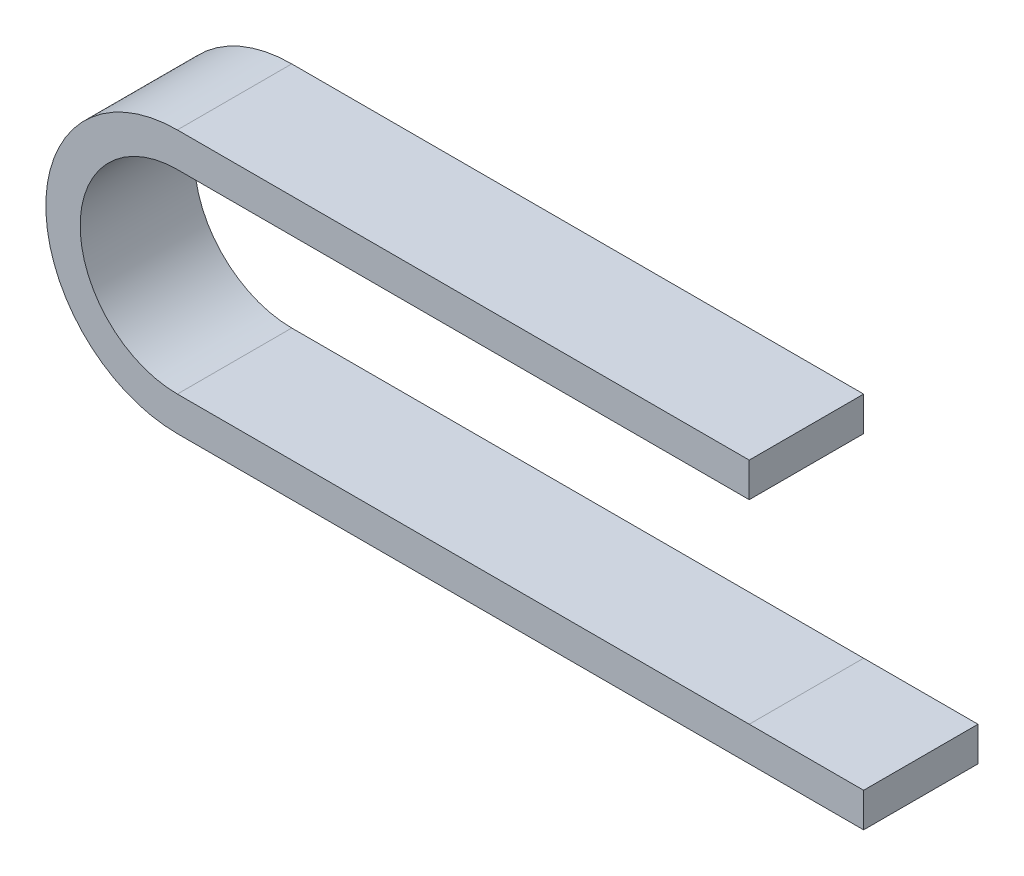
ISO-10303-21;
HEADER;
FILE_DESCRIPTION(('STEP AP214'),'2;1');
FILE_NAME('part.step','',(''),(''),'','','');
FILE_SCHEMA(('AUTOMOTIVE_DESIGN { 1 0 10303 214 1 1 1 1 }'));
ENDSEC;
DATA;
#1=APPLICATION_CONTEXT('core data for automotive mechanical design processes');
#2=APPLICATION_PROTOCOL_DEFINITION('international standard','automotive_design',2000,#1);
#3=PRODUCT_CONTEXT('',#1,'mechanical');
#4=PRODUCT('Part','Part','',(#3));
#5=PRODUCT_RELATED_PRODUCT_CATEGORY('part','',(#4));
#6=PRODUCT_DEFINITION_FORMATION('','',#4);
#7=PRODUCT_DEFINITION_CONTEXT('part definition',#1,'design');
#8=PRODUCT_DEFINITION('design','',#6,#7);
#9=PRODUCT_DEFINITION_SHAPE('','',#8);
#10=(LENGTH_UNIT() NAMED_UNIT(*) SI_UNIT(.MILLI.,.METRE.));
#11=(NAMED_UNIT(*) PLANE_ANGLE_UNIT() SI_UNIT($,.RADIAN.));
#12=(NAMED_UNIT(*) SI_UNIT($,.STERADIAN.) SOLID_ANGLE_UNIT());
#13=UNCERTAINTY_MEASURE_WITH_UNIT(LENGTH_MEASURE(1.E-05),#10,'distance_accuracy_value','');
#14=(GEOMETRIC_REPRESENTATION_CONTEXT(3) GLOBAL_UNCERTAINTY_ASSIGNED_CONTEXT((#13)) GLOBAL_UNIT_ASSIGNED_CONTEXT((#10,
#11,#12)) REPRESENTATION_CONTEXT('',''));
#15=CARTESIAN_POINT('',(0.,0.,0.));
#16=DIRECTION('',(0.,0.,1.));
#17=DIRECTION('',(1.,0.,0.));
#18=AXIS2_PLACEMENT_3D('',#15,#16,#17);
#19=CARTESIAN_POINT('',(0.,0.75,2.5));
#20=DIRECTION('',(0.,1.,0.));
#21=DIRECTION('',(0.,0.,1.));
#22=AXIS2_PLACEMENT_3D('',#19,#20,#21);
#23=PLANE('',#22);
#24=DIRECTION('',(1.,0.,0.));
#25=VECTOR('',#24,1.);
#26=CARTESIAN_POINT('',(0.,0.75,2.5));
#27=LINE('',#26,#25);
#28=CARTESIAN_POINT('',(0.,0.75,2.5));
#29=VERTEX_POINT('',#28);
#30=CARTESIAN_POINT('',(25.,0.75,2.5));
#31=VERTEX_POINT('',#30);
#32=EDGE_CURVE('E143',#29,#31,#27,.T.);
#33=ORIENTED_EDGE('',*,*,#32,.T.);
#34=DIRECTION('',(0.,0.,-1.));
#35=VECTOR('',#34,1.);
#36=CARTESIAN_POINT('',(25.,0.75,2.5));
#37=LINE('',#36,#35);
#38=CARTESIAN_POINT('',(25.,0.75,-2.5));
#39=VERTEX_POINT('',#38);
#40=EDGE_CURVE('E11',#31,#39,#37,.T.);
#41=ORIENTED_EDGE('',*,*,#40,.T.);
#42=DIRECTION('',(1.,0.,0.));
#43=VECTOR('',#42,1.);
#44=CARTESIAN_POINT('',(0.,0.75,-2.5));
#45=LINE('',#44,#43);
#46=CARTESIAN_POINT('',(0.,0.75,-2.5));
#47=VERTEX_POINT('',#46);
#48=EDGE_CURVE('E189',#47,#39,#45,.T.);
#49=ORIENTED_EDGE('',*,*,#48,.F.);
#50=DIRECTION('',(0.,0.,1.));
#51=VECTOR('',#50,1.);
#52=CARTESIAN_POINT('',(0.,0.75,2.5));
#53=LINE('',#52,#51);
#54=EDGE_CURVE('E129',#47,#29,#53,.T.);
#55=ORIENTED_EDGE('',*,*,#54,.T.);
#56=EDGE_LOOP('',(#33,#41,#49,#55));
#57=FACE_BOUND('',#56,.T.);
#58=ADVANCED_FACE('F33',(#57),#23,.T.);
#59=CARTESIAN_POINT('',(0.,-0.750000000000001,2.5));
#60=DIRECTION('',(0.,-1.,0.));
#61=DIRECTION('',(0.,0.,-1.));
#62=AXIS2_PLACEMENT_3D('',#59,#60,#61);
#63=PLANE('',#62);
#64=DIRECTION('',(1.,0.,0.));
#65=VECTOR('',#64,1.);
#66=CARTESIAN_POINT('',(0.,-0.750000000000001,-2.5));
#67=LINE('',#66,#65);
#68=CARTESIAN_POINT('',(0.,-0.750000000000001,-2.5));
#69=VERTEX_POINT('',#68);
#70=CARTESIAN_POINT('',(25.,-0.750000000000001,-2.5));
#71=VERTEX_POINT('',#70);
#72=EDGE_CURVE('E137',#69,#71,#67,.T.);
#73=ORIENTED_EDGE('',*,*,#72,.T.);
#74=DIRECTION('',(0.,0.,1.));
#75=VECTOR('',#74,1.);
#76=CARTESIAN_POINT('',(25.,-0.750000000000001,2.5));
#77=LINE('',#76,#75);
#78=CARTESIAN_POINT('',(25.,-0.750000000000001,2.5));
#79=VERTEX_POINT('',#78);
#80=EDGE_CURVE('E37',#71,#79,#77,.T.);
#81=ORIENTED_EDGE('',*,*,#80,.T.);
#82=DIRECTION('',(1.,0.,0.));
#83=VECTOR('',#82,1.);
#84=CARTESIAN_POINT('',(0.,-0.750000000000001,2.5));
#85=LINE('',#84,#83);
#86=CARTESIAN_POINT('',(0.,-0.750000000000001,2.5));
#87=VERTEX_POINT('',#86);
#88=EDGE_CURVE('E113',#87,#79,#85,.T.);
#89=ORIENTED_EDGE('',*,*,#88,.F.);
#90=DIRECTION('',(0.,0.,-1.));
#91=VECTOR('',#90,1.);
#92=CARTESIAN_POINT('',(0.,-0.750000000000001,2.5));
#93=LINE('',#92,#91);
#94=EDGE_CURVE('E123',#87,#69,#93,.T.);
#95=ORIENTED_EDGE('',*,*,#94,.T.);
#96=EDGE_LOOP('',(#73,#81,#89,#95));
#97=FACE_BOUND('',#96,.T.);
#98=ADVANCED_FACE('F132',(#97),#63,.T.);
#99=CARTESIAN_POINT('',(0.,9.25,2.5));
#100=DIRECTION('',(0.,1.,0.));
#101=DIRECTION('',(-1.,0.,0.));
#102=AXIS2_PLACEMENT_3D('',#99,#100,#101);
#103=PLANE('',#102);
#104=DIRECTION('',(0.,0.,1.));
#105=VECTOR('',#104,1.);
#106=CARTESIAN_POINT('',(0.,9.25,2.5));
#107=LINE('',#106,#105);
#108=CARTESIAN_POINT('',(0.,9.25,-2.5));
#109=VERTEX_POINT('',#108);
#110=CARTESIAN_POINT('',(0.,9.25,2.5));
#111=VERTEX_POINT('',#110);
#112=EDGE_CURVE('E120',#109,#111,#107,.T.);
#113=ORIENTED_EDGE('',*,*,#112,.F.);
#114=DIRECTION('',(1.,0.,0.));
#115=VECTOR('',#114,1.);
#116=CARTESIAN_POINT('',(0.,9.25,-2.5));
#117=LINE('',#116,#115);
#118=CARTESIAN_POINT('',(25.0000000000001,9.25,-2.5));
#119=VERTEX_POINT('',#118);
#120=EDGE_CURVE('E165',#109,#119,#117,.T.);
#121=ORIENTED_EDGE('',*,*,#120,.T.);
#122=DIRECTION('',(0.,0.,1.));
#123=VECTOR('',#122,1.);
#124=CARTESIAN_POINT('',(25.0000000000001,9.25,2.5));
#125=LINE('',#124,#123);
#126=CARTESIAN_POINT('',(25.0000000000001,9.25,2.5));
#127=VERTEX_POINT('',#126);
#128=EDGE_CURVE('E159',#119,#127,#125,.T.);
#129=ORIENTED_EDGE('',*,*,#128,.T.);
#130=DIRECTION('',(1.,0.,0.));
#131=VECTOR('',#130,1.);
#132=CARTESIAN_POINT('',(0.,9.25,2.5));
#133=LINE('',#132,#131);
#134=EDGE_CURVE('E168',#111,#127,#133,.T.);
#135=ORIENTED_EDGE('',*,*,#134,.F.);
#136=EDGE_LOOP('',(#113,#121,#129,#135));
#137=FACE_BOUND('',#136,.T.);
#138=ADVANCED_FACE('F35',(#137),#103,.F.);
#139=CARTESIAN_POINT('',(0.,10.75,2.5));
#140=DIRECTION('',(0.,-1.,0.));
#141=DIRECTION('',(1.,0.,0.));
#142=AXIS2_PLACEMENT_3D('',#139,#140,#141);
#143=PLANE('',#142);
#144=DIRECTION('',(0.,0.,-1.));
#145=VECTOR('',#144,1.);
#146=CARTESIAN_POINT('',(0.,10.75,2.5));
#147=LINE('',#146,#145);
#148=CARTESIAN_POINT('',(0.,10.75,2.5));
#149=VERTEX_POINT('',#148);
#150=CARTESIAN_POINT('',(0.,10.75,-2.5));
#151=VERTEX_POINT('',#150);
#152=EDGE_CURVE('E141',#149,#151,#147,.T.);
#153=ORIENTED_EDGE('',*,*,#152,.F.);
#154=DIRECTION('',(1.,0.,0.));
#155=VECTOR('',#154,1.);
#156=CARTESIAN_POINT('',(0.,10.75,2.5));
#157=LINE('',#156,#155);
#158=CARTESIAN_POINT('',(25.0000000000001,10.75,2.5));
#159=VERTEX_POINT('',#158);
#160=EDGE_CURVE('E115',#149,#159,#157,.T.);
#161=ORIENTED_EDGE('',*,*,#160,.T.);
#162=DIRECTION('',(0.,0.,-1.));
#163=VECTOR('',#162,1.);
#164=CARTESIAN_POINT('',(25.0000000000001,10.75,2.5));
#165=LINE('',#164,#163);
#166=CARTESIAN_POINT('',(25.0000000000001,10.75,-2.5));
#167=VERTEX_POINT('',#166);
#168=EDGE_CURVE('E155',#159,#167,#165,.T.);
#169=ORIENTED_EDGE('',*,*,#168,.T.);
#170=DIRECTION('',(1.,0.,0.));
#171=VECTOR('',#170,1.);
#172=CARTESIAN_POINT('',(0.,10.75,-2.5));
#173=LINE('',#172,#171);
#174=EDGE_CURVE('E162',#151,#167,#173,.T.);
#175=ORIENTED_EDGE('',*,*,#174,.F.);
#176=EDGE_LOOP('',(#153,#161,#169,#175));
#177=FACE_BOUND('',#176,.T.);
#178=ADVANCED_FACE('F194',(#177),#143,.F.);
#179=CARTESIAN_POINT('',(0.,5.,0.));
#180=DIRECTION('',(0.,0.,-1.));
#181=DIRECTION('',(-1.,0.,0.));
#182=AXIS2_PLACEMENT_3D('',#179,#180,#181);
#183=CYLINDRICAL_SURFACE('',#182,4.25);
#184=ORIENTED_EDGE('',*,*,#54,.F.);
#185=CARTESIAN_POINT('',(0.,5.,-2.5));
#186=DIRECTION('',(0.,0.,-1.));
#187=DIRECTION('',(-1.,0.,0.));
#188=AXIS2_PLACEMENT_3D('',#185,#186,#187);
#189=CIRCLE('',#188,4.25);
#190=EDGE_CURVE('E147',#47,#109,#189,.T.);
#191=ORIENTED_EDGE('',*,*,#190,.T.);
#192=ORIENTED_EDGE('',*,*,#112,.T.);
#193=CARTESIAN_POINT('',(0.,5.,2.5));
#194=DIRECTION('',(0.,0.,-1.));
#195=DIRECTION('',(-1.,0.,0.));
#196=AXIS2_PLACEMENT_3D('',#193,#194,#195);
#197=CIRCLE('',#196,4.25);
#198=EDGE_CURVE('E150',#29,#111,#197,.T.);
#199=ORIENTED_EDGE('',*,*,#198,.F.);
#200=EDGE_LOOP('',(#184,#191,#192,#199));
#201=FACE_BOUND('',#200,.T.);
#202=ADVANCED_FACE('F183',(#201),#183,.F.);
#203=CARTESIAN_POINT('',(0.,5.,0.));
#204=DIRECTION('',(0.,0.,-1.));
#205=DIRECTION('',(-1.,0.,0.));
#206=AXIS2_PLACEMENT_3D('',#203,#204,#205);
#207=CYLINDRICAL_SURFACE('',#206,5.75);
#208=ORIENTED_EDGE('',*,*,#94,.F.);
#209=CARTESIAN_POINT('',(0.,5.,2.5));
#210=DIRECTION('',(0.,0.,-1.));
#211=DIRECTION('',(-1.,0.,0.));
#212=AXIS2_PLACEMENT_3D('',#209,#210,#211);
#213=CIRCLE('',#212,5.75);
#214=EDGE_CURVE('E108',#87,#149,#213,.T.);
#215=ORIENTED_EDGE('',*,*,#214,.T.);
#216=ORIENTED_EDGE('',*,*,#152,.T.);
#217=CARTESIAN_POINT('',(0.,5.,-2.5));
#218=DIRECTION('',(0.,0.,-1.));
#219=DIRECTION('',(-1.,0.,0.));
#220=AXIS2_PLACEMENT_3D('',#217,#218,#219);
#221=CIRCLE('',#220,5.75);
#222=EDGE_CURVE('E119',#69,#151,#221,.T.);
#223=ORIENTED_EDGE('',*,*,#222,.F.);
#224=EDGE_LOOP('',(#208,#215,#216,#223));
#225=FACE_BOUND('',#224,.T.);
#226=ADVANCED_FACE('F124',(#225),#207,.T.);
#227=CARTESIAN_POINT('',(0.,0.75,2.5));
#228=DIRECTION('',(0.,0.,1.));
#229=DIRECTION('',(0.,-1.,0.));
#230=AXIS2_PLACEMENT_3D('',#227,#228,#229);
#231=PLANE('',#230);
#232=DIRECTION('',(0.,-1.,0.));
#233=VECTOR('',#232,1.);
#234=CARTESIAN_POINT('',(30.,0.75,2.5));
#235=LINE('',#234,#233);
#236=CARTESIAN_POINT('',(30.,0.75,2.5));
#237=VERTEX_POINT('',#236);
#238=CARTESIAN_POINT('',(30.,-0.750000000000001,2.5));
#239=VERTEX_POINT('',#238);
#240=EDGE_CURVE('E208',#237,#239,#235,.T.);
#241=ORIENTED_EDGE('',*,*,#240,.F.);
#242=EDGE_CURVE('E198',#31,#237,#27,.T.);
#243=ORIENTED_EDGE('',*,*,#242,.F.);
#244=ORIENTED_EDGE('',*,*,#32,.F.);
#245=ORIENTED_EDGE('',*,*,#198,.T.);
#246=ORIENTED_EDGE('',*,*,#134,.T.);
#247=DIRECTION('',(0.,1.,0.));
#248=VECTOR('',#247,1.);
#249=CARTESIAN_POINT('',(25.0000000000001,9.25,2.5));
#250=LINE('',#249,#248);
#251=EDGE_CURVE('E153',#127,#159,#250,.T.);
#252=ORIENTED_EDGE('',*,*,#251,.T.);
#253=ORIENTED_EDGE('',*,*,#160,.F.);
#254=ORIENTED_EDGE('',*,*,#214,.F.);
#255=ORIENTED_EDGE('',*,*,#88,.T.);
#256=EDGE_CURVE('E135',#79,#239,#85,.T.);
#257=ORIENTED_EDGE('',*,*,#256,.T.);
#258=EDGE_LOOP('',(#241,#243,#244,#245,#246,#252,#253,#254,#255,#257));
#259=FACE_BOUND('',#258,.T.);
#260=ADVANCED_FACE('F111',(#259),#231,.T.);
#261=ORIENTED_EDGE('',*,*,#40,.F.);
#262=ORIENTED_EDGE('',*,*,#242,.T.);
#263=DIRECTION('',(0.,0.,1.));
#264=VECTOR('',#263,1.);
#265=CARTESIAN_POINT('',(30.,0.75,2.5));
#266=LINE('',#265,#264);
#267=CARTESIAN_POINT('',(30.,0.75,-2.5));
#268=VERTEX_POINT('',#267);
#269=EDGE_CURVE('E130',#268,#237,#266,.T.);
#270=ORIENTED_EDGE('',*,*,#269,.F.);
#271=EDGE_CURVE('E196',#39,#268,#45,.T.);
#272=ORIENTED_EDGE('',*,*,#271,.F.);
#273=EDGE_LOOP('',(#261,#262,#270,#272));
#274=FACE_BOUND('',#273,.T.);
#275=ADVANCED_FACE('F212',(#274),#23,.T.);
#276=CARTESIAN_POINT('',(0.,0.75,-2.5));
#277=DIRECTION('',(0.,0.,-1.));
#278=DIRECTION('',(0.,1.,0.));
#279=AXIS2_PLACEMENT_3D('',#276,#277,#278);
#280=PLANE('',#279);
#281=DIRECTION('',(0.,1.,0.));
#282=VECTOR('',#281,1.);
#283=CARTESIAN_POINT('',(30.,0.75,-2.5));
#284=LINE('',#283,#282);
#285=CARTESIAN_POINT('',(30.,-0.750000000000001,-2.5));
#286=VERTEX_POINT('',#285);
#287=EDGE_CURVE('E203',#286,#268,#284,.T.);
#288=ORIENTED_EDGE('',*,*,#287,.F.);
#289=EDGE_CURVE('E134',#71,#286,#67,.T.);
#290=ORIENTED_EDGE('',*,*,#289,.F.);
#291=ORIENTED_EDGE('',*,*,#72,.F.);
#292=ORIENTED_EDGE('',*,*,#222,.T.);
#293=ORIENTED_EDGE('',*,*,#174,.T.);
#294=DIRECTION('',(0.,-1.,0.));
#295=VECTOR('',#294,1.);
#296=CARTESIAN_POINT('',(25.0000000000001,9.25,-2.5));
#297=LINE('',#296,#295);
#298=EDGE_CURVE('E157',#167,#119,#297,.T.);
#299=ORIENTED_EDGE('',*,*,#298,.T.);
#300=ORIENTED_EDGE('',*,*,#120,.F.);
#301=ORIENTED_EDGE('',*,*,#190,.F.);
#302=ORIENTED_EDGE('',*,*,#48,.T.);
#303=ORIENTED_EDGE('',*,*,#271,.T.);
#304=EDGE_LOOP('',(#288,#290,#291,#292,#293,#299,#300,#301,#302,#303));
#305=FACE_BOUND('',#304,.T.);
#306=ADVANCED_FACE('F188',(#305),#280,.T.);
#307=ORIENTED_EDGE('',*,*,#80,.F.);
#308=ORIENTED_EDGE('',*,*,#289,.T.);
#309=DIRECTION('',(0.,0.,-1.));
#310=VECTOR('',#309,1.);
#311=CARTESIAN_POINT('',(30.,-0.750000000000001,2.5));
#312=LINE('',#311,#310);
#313=EDGE_CURVE('E205',#239,#286,#312,.T.);
#314=ORIENTED_EDGE('',*,*,#313,.F.);
#315=ORIENTED_EDGE('',*,*,#256,.F.);
#316=EDGE_LOOP('',(#307,#308,#314,#315));
#317=FACE_BOUND('',#316,.T.);
#318=ADVANCED_FACE('F217',(#317),#63,.T.);
#319=CARTESIAN_POINT('',(25.0000000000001,10.75,2.5));
#320=DIRECTION('',(-1.,0.,0.));
#321=DIRECTION('',(0.,0.,-1.));
#322=AXIS2_PLACEMENT_3D('',#319,#320,#321);
#323=PLANE('',#322);
#324=ORIENTED_EDGE('',*,*,#251,.F.);
#325=ORIENTED_EDGE('',*,*,#128,.F.);
#326=ORIENTED_EDGE('',*,*,#298,.F.);
#327=ORIENTED_EDGE('',*,*,#168,.F.);
#328=EDGE_LOOP('',(#324,#325,#326,#327));
#329=FACE_BOUND('',#328,.T.);
#330=ADVANCED_FACE('F192',(#329),#323,.F.);
#331=CARTESIAN_POINT('',(30.,-0.750000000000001,2.5));
#332=DIRECTION('',(1.,0.,0.));
#333=DIRECTION('',(0.,0.,-1.));
#334=AXIS2_PLACEMENT_3D('',#331,#332,#333);
#335=PLANE('',#334);
#336=ORIENTED_EDGE('',*,*,#240,.T.);
#337=ORIENTED_EDGE('',*,*,#313,.T.);
#338=ORIENTED_EDGE('',*,*,#287,.T.);
#339=ORIENTED_EDGE('',*,*,#269,.T.);
#340=EDGE_LOOP('',(#336,#337,#338,#339));
#341=FACE_BOUND('',#340,.T.);
#342=ADVANCED_FACE('F214',(#341),#335,.T.);
#343=CLOSED_SHELL('',(#58,#98,#138,#178,#202,#226,#260,#275,#306,#318,#330,#342));
#344=MANIFOLD_SOLID_BREP('B2',#343);
#345=ADVANCED_BREP_SHAPE_REPRESENTATION('',(#18,#344),#14);
#346=SHAPE_DEFINITION_REPRESENTATION(#9,#345);
ENDSEC;
END-ISO-10303-21;
